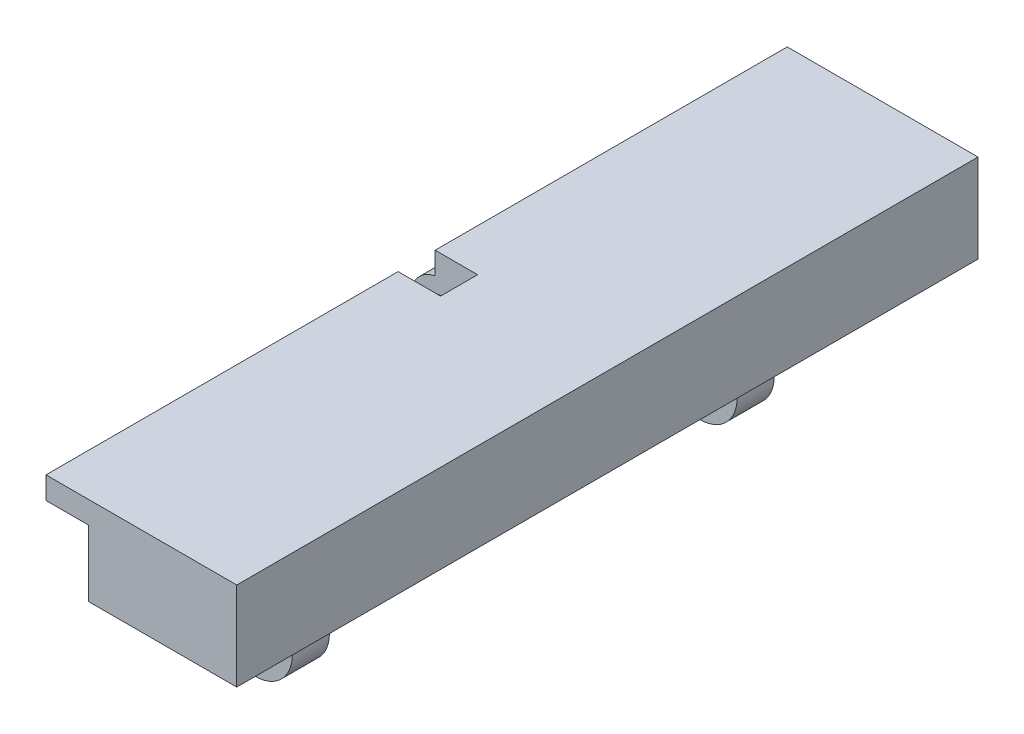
ISO-10303-21;
HEADER;
FILE_DESCRIPTION(('STEP AP214'),'2;1');
FILE_NAME('part.step','',(''),(''),'','','');
FILE_SCHEMA(('AUTOMOTIVE_DESIGN { 1 0 10303 214 1 1 1 1 }'));
ENDSEC;
DATA;
#1=APPLICATION_CONTEXT('core data for automotive mechanical design processes');
#2=APPLICATION_PROTOCOL_DEFINITION('international standard','automotive_design',2000,#1);
#3=PRODUCT_CONTEXT('',#1,'mechanical');
#4=PRODUCT('Part','Part','',(#3));
#5=PRODUCT_RELATED_PRODUCT_CATEGORY('part','',(#4));
#6=PRODUCT_DEFINITION_FORMATION('','',#4);
#7=PRODUCT_DEFINITION_CONTEXT('part definition',#1,'design');
#8=PRODUCT_DEFINITION('design','',#6,#7);
#9=PRODUCT_DEFINITION_SHAPE('','',#8);
#10=(LENGTH_UNIT() NAMED_UNIT(*) SI_UNIT(.MILLI.,.METRE.));
#11=(NAMED_UNIT(*) PLANE_ANGLE_UNIT() SI_UNIT($,.RADIAN.));
#12=(NAMED_UNIT(*) SI_UNIT($,.STERADIAN.) SOLID_ANGLE_UNIT());
#13=UNCERTAINTY_MEASURE_WITH_UNIT(LENGTH_MEASURE(1.E-05),#10,'distance_accuracy_value','');
#14=(GEOMETRIC_REPRESENTATION_CONTEXT(3) GLOBAL_UNCERTAINTY_ASSIGNED_CONTEXT((#13)) GLOBAL_UNIT_ASSIGNED_CONTEXT((#10,
#11,#12)) REPRESENTATION_CONTEXT('',''));
#15=CARTESIAN_POINT('',(0.,0.,0.));
#16=DIRECTION('',(0.,0.,1.));
#17=DIRECTION('',(1.,0.,0.));
#18=AXIS2_PLACEMENT_3D('',#15,#16,#17);
#19=CARTESIAN_POINT('',(-157.323807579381,100.,-500.));
#20=DIRECTION('',(-1.,0.,0.));
#21=DIRECTION('',(0.,0.,1.));
#22=AXIS2_PLACEMENT_3D('',#19,#20,#21);
#23=PLANE('',#22);
#24=DIRECTION('',(0.,1.,0.));
#25=VECTOR('',#24,1.);
#26=CARTESIAN_POINT('',(-157.323807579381,100.,25.));
#27=LINE('',#26,#25);
#28=CARTESIAN_POINT('',(-157.323807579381,89.3238075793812,25.));
#29=VERTEX_POINT('',#28);
#30=CARTESIAN_POINT('',(-157.323807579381,119.323807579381,25.));
#31=VERTEX_POINT('',#30);
#32=EDGE_CURVE('E217',#29,#31,#27,.T.);
#33=ORIENTED_EDGE('',*,*,#32,.F.);
#34=DIRECTION('',(0.,0.,-1.));
#35=VECTOR('',#34,1.);
#36=CARTESIAN_POINT('',(-157.323807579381,89.3238075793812,75.));
#37=LINE('',#36,#35);
#38=CARTESIAN_POINT('',(-157.323807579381,89.3238075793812,75.));
#39=VERTEX_POINT('',#38);
#40=EDGE_CURVE('E310',#39,#29,#37,.T.);
#41=ORIENTED_EDGE('',*,*,#40,.F.);
#42=DIRECTION('',(0.,0.,1.));
#43=VECTOR('',#42,1.);
#44=CARTESIAN_POINT('',(-157.323807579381,89.3238075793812,-500.));
#45=LINE('',#44,#43);
#46=CARTESIAN_POINT('',(-157.323807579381,89.3238075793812,500.));
#47=VERTEX_POINT('',#46);
#48=EDGE_CURVE('E247',#39,#47,#45,.T.);
#49=ORIENTED_EDGE('',*,*,#48,.T.);
#50=DIRECTION('',(0.,-1.,0.));
#51=VECTOR('',#50,1.);
#52=CARTESIAN_POINT('',(-157.323807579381,100.,500.));
#53=LINE('',#52,#51);
#54=CARTESIAN_POINT('',(-157.323807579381,119.323807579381,500.));
#55=VERTEX_POINT('',#54);
#56=EDGE_CURVE('E237',#55,#47,#53,.T.);
#57=ORIENTED_EDGE('',*,*,#56,.F.);
#58=DIRECTION('',(0.,0.,1.));
#59=VECTOR('',#58,1.);
#60=CARTESIAN_POINT('',(-157.323807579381,119.323807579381,-500.));
#61=LINE('',#60,#59);
#62=EDGE_CURVE('E238',#31,#55,#61,.T.);
#63=ORIENTED_EDGE('',*,*,#62,.F.);
#64=EDGE_LOOP('',(#33,#41,#49,#57,#63));
#65=FACE_BOUND('',#64,.T.);
#66=ADVANCED_FACE('F33',(#65),#23,.T.);
#67=CARTESIAN_POINT('',(-100.,0.,500.));
#68=DIRECTION('',(1.,0.,0.));
#69=DIRECTION('',(0.,0.,-1.));
#70=AXIS2_PLACEMENT_3D('',#67,#68,#69);
#71=PLANE('',#70);
#72=DIRECTION('',(0.,1.,0.));
#73=VECTOR('',#72,1.);
#74=CARTESIAN_POINT('',(-100.,100.,25.));
#75=LINE('',#74,#73);
#76=CARTESIAN_POINT('',(-100.,0.,25.));
#77=VERTEX_POINT('',#76);
#78=CARTESIAN_POINT('',(-100.,119.323807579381,25.));
#79=VERTEX_POINT('',#78);
#80=EDGE_CURVE('E199',#77,#79,#75,.T.);
#81=ORIENTED_EDGE('',*,*,#80,.T.);
#82=DIRECTION('',(0.,0.,1.));
#83=VECTOR('',#82,1.);
#84=CARTESIAN_POINT('',(-100.,119.323807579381,25.));
#85=LINE('',#84,#83);
#86=CARTESIAN_POINT('',(-100.,119.323807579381,-25.));
#87=VERTEX_POINT('',#86);
#88=EDGE_CURVE('E203',#87,#79,#85,.T.);
#89=ORIENTED_EDGE('',*,*,#88,.F.);
#90=DIRECTION('',(0.,1.,0.));
#91=VECTOR('',#90,1.);
#92=CARTESIAN_POINT('',(-100.,100.,-25.));
#93=LINE('',#92,#91);
#94=CARTESIAN_POINT('',(-100.,0.,-25.));
#95=VERTEX_POINT('',#94);
#96=EDGE_CURVE('E47',#95,#87,#93,.T.);
#97=ORIENTED_EDGE('',*,*,#96,.F.);
#98=DIRECTION('',(0.,0.,-1.));
#99=VECTOR('',#98,1.);
#100=CARTESIAN_POINT('',(-100.,0.,500.));
#101=LINE('',#100,#99);
#102=EDGE_CURVE('E206',#77,#95,#101,.T.);
#103=ORIENTED_EDGE('',*,*,#102,.F.);
#104=EDGE_LOOP('',(#81,#89,#97,#103));
#105=FACE_BOUND('',#104,.T.);
#106=ADVANCED_FACE('F201',(#105),#71,.F.);
#107=DIRECTION('',(0.,1.,0.));
#108=VECTOR('',#107,1.);
#109=CARTESIAN_POINT('',(-100.,100.,-75.));
#110=LINE('',#109,#108);
#111=CARTESIAN_POINT('',(-100.,0.,-75.));
#112=VERTEX_POINT('',#111);
#113=CARTESIAN_POINT('',(-100.,89.3238075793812,-75.));
#114=VERTEX_POINT('',#113);
#115=EDGE_CURVE('E272',#112,#114,#110,.T.);
#116=ORIENTED_EDGE('',*,*,#115,.T.);
#117=DIRECTION('',(0.,0.,1.));
#118=VECTOR('',#117,1.);
#119=CARTESIAN_POINT('',(-100.,89.3238075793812,-500.));
#120=LINE('',#119,#118);
#121=CARTESIAN_POINT('',(-100.,89.3238075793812,-500.));
#122=VERTEX_POINT('',#121);
#123=EDGE_CURVE('E252',#122,#114,#120,.T.);
#124=ORIENTED_EDGE('',*,*,#123,.F.);
#125=DIRECTION('',(0.,-1.,0.));
#126=VECTOR('',#125,1.);
#127=CARTESIAN_POINT('',(-100.,0.,-500.));
#128=LINE('',#127,#126);
#129=CARTESIAN_POINT('',(-100.,0.,-500.));
#130=VERTEX_POINT('',#129);
#131=EDGE_CURVE('E503',#122,#130,#128,.T.);
#132=ORIENTED_EDGE('',*,*,#131,.T.);
#133=CARTESIAN_POINT('',(-100.,0.,-325.));
#134=VERTEX_POINT('',#133);
#135=EDGE_CURVE('E378',#134,#130,#101,.T.);
#136=ORIENTED_EDGE('',*,*,#135,.F.);
#137=DIRECTION('',(0.,-1.,0.));
#138=VECTOR('',#137,1.);
#139=CARTESIAN_POINT('',(-100.,0.,-325.));
#140=LINE('',#139,#138);
#141=CARTESIAN_POINT('',(-100.,-100.,-325.));
#142=VERTEX_POINT('',#141);
#143=EDGE_CURVE('E327',#134,#142,#140,.T.);
#144=ORIENTED_EDGE('',*,*,#143,.T.);
#145=DIRECTION('',(0.,0.,1.));
#146=VECTOR('',#145,1.);
#147=CARTESIAN_POINT('',(-100.,-100.,-325.));
#148=LINE('',#147,#146);
#149=CARTESIAN_POINT('',(-100.,-100.,-275.));
#150=VERTEX_POINT('',#149);
#151=EDGE_CURVE('E348',#142,#150,#148,.T.);
#152=ORIENTED_EDGE('',*,*,#151,.T.);
#153=DIRECTION('',(0.,-1.,0.));
#154=VECTOR('',#153,1.);
#155=CARTESIAN_POINT('',(-100.,0.,-275.));
#156=LINE('',#155,#154);
#157=CARTESIAN_POINT('',(-100.,0.,-275.));
#158=VERTEX_POINT('',#157);
#159=EDGE_CURVE('E339',#158,#150,#156,.T.);
#160=ORIENTED_EDGE('',*,*,#159,.F.);
#161=EDGE_CURVE('E55',#112,#158,#101,.T.);
#162=ORIENTED_EDGE('',*,*,#161,.F.);
#163=EDGE_LOOP('',(#116,#124,#132,#136,#144,#152,#160,#162));
#164=FACE_BOUND('',#163,.T.);
#165=ADVANCED_FACE('F428',(#164),#71,.F.);
#166=DIRECTION('',(0.,-1.,0.));
#167=VECTOR('',#166,1.);
#168=CARTESIAN_POINT('',(-100.,0.,500.));
#169=LINE('',#168,#167);
#170=CARTESIAN_POINT('',(-100.,89.3238075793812,500.));
#171=VERTEX_POINT('',#170);
#172=CARTESIAN_POINT('',(-100.,0.,500.));
#173=VERTEX_POINT('',#172);
#174=EDGE_CURVE('E490',#171,#173,#169,.T.);
#175=ORIENTED_EDGE('',*,*,#174,.F.);
#176=CARTESIAN_POINT('',(-100.,89.3238075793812,75.));
#177=VERTEX_POINT('',#176);
#178=EDGE_CURVE('E255',#177,#171,#120,.T.);
#179=ORIENTED_EDGE('',*,*,#178,.F.);
#180=DIRECTION('',(0.,1.,0.));
#181=VECTOR('',#180,1.);
#182=CARTESIAN_POINT('',(-100.,100.,75.));
#183=LINE('',#182,#181);
#184=CARTESIAN_POINT('',(-100.,0.,75.));
#185=VERTEX_POINT('',#184);
#186=EDGE_CURVE('E293',#185,#177,#183,.T.);
#187=ORIENTED_EDGE('',*,*,#186,.F.);
#188=CARTESIAN_POINT('',(-100.,0.,275.));
#189=VERTEX_POINT('',#188);
#190=EDGE_CURVE('E392',#189,#185,#101,.T.);
#191=ORIENTED_EDGE('',*,*,#190,.F.);
#192=DIRECTION('',(0.,-1.,0.));
#193=VECTOR('',#192,1.);
#194=CARTESIAN_POINT('',(-100.,0.,275.));
#195=LINE('',#194,#193);
#196=CARTESIAN_POINT('',(-100.,-100.,275.));
#197=VERTEX_POINT('',#196);
#198=EDGE_CURVE('E355',#189,#197,#195,.T.);
#199=ORIENTED_EDGE('',*,*,#198,.T.);
#200=DIRECTION('',(0.,0.,-1.));
#201=VECTOR('',#200,1.);
#202=CARTESIAN_POINT('',(-100.,-100.,325.));
#203=LINE('',#202,#201);
#204=CARTESIAN_POINT('',(-100.,-100.,325.));
#205=VERTEX_POINT('',#204);
#206=EDGE_CURVE('E367',#205,#197,#203,.T.);
#207=ORIENTED_EDGE('',*,*,#206,.F.);
#208=DIRECTION('',(0.,-1.,0.));
#209=VECTOR('',#208,1.);
#210=CARTESIAN_POINT('',(-100.,0.,325.));
#211=LINE('',#210,#209);
#212=CARTESIAN_POINT('',(-100.,0.,325.));
#213=VERTEX_POINT('',#212);
#214=EDGE_CURVE('E864',#213,#205,#211,.T.);
#215=ORIENTED_EDGE('',*,*,#214,.F.);
#216=EDGE_CURVE('E388',#173,#213,#101,.T.);
#217=ORIENTED_EDGE('',*,*,#216,.F.);
#218=EDGE_LOOP('',(#175,#179,#187,#191,#199,#207,#215,#217));
#219=FACE_BOUND('',#218,.T.);
#220=ADVANCED_FACE('F430',(#219),#71,.F.);
#221=CARTESIAN_POINT('',(-100.,0.,500.));
#222=DIRECTION('',(0.,1.,0.));
#223=DIRECTION('',(0.,0.,1.));
#224=AXIS2_PLACEMENT_3D('',#221,#222,#223);
#225=PLANE('',#224);
#226=DIRECTION('',(0.,0.,-1.));
#227=VECTOR('',#226,1.);
#228=CARTESIAN_POINT('',(50.,0.,275.));
#229=LINE('',#228,#227);
#230=CARTESIAN_POINT('',(50.,0.,325.));
#231=VERTEX_POINT('',#230);
#232=CARTESIAN_POINT('',(50.,0.,275.));
#233=VERTEX_POINT('',#232);
#234=EDGE_CURVE('E515',#231,#233,#229,.T.);
#235=ORIENTED_EDGE('',*,*,#234,.T.);
#236=DIRECTION('',(-1.,0.,0.));
#237=VECTOR('',#236,1.);
#238=CARTESIAN_POINT('',(-100.,0.,275.));
#239=LINE('',#238,#237);
#240=EDGE_CURVE('E364',#233,#189,#239,.T.);
#241=ORIENTED_EDGE('',*,*,#240,.T.);
#242=ORIENTED_EDGE('',*,*,#190,.T.);
#243=DIRECTION('',(0.,0.,-1.));
#244=VECTOR('',#243,1.);
#245=CARTESIAN_POINT('',(-100.,0.,75.));
#246=LINE('',#245,#244);
#247=EDGE_CURVE('E301',#185,#77,#246,.T.);
#248=ORIENTED_EDGE('',*,*,#247,.T.);
#249=ORIENTED_EDGE('',*,*,#102,.T.);
#250=DIRECTION('',(0.,0.,1.));
#251=VECTOR('',#250,1.);
#252=CARTESIAN_POINT('',(-100.,0.,-75.));
#253=LINE('',#252,#251);
#254=EDGE_CURVE('E211',#112,#95,#253,.T.);
#255=ORIENTED_EDGE('',*,*,#254,.F.);
#256=ORIENTED_EDGE('',*,*,#161,.T.);
#257=DIRECTION('',(-1.,0.,0.));
#258=VECTOR('',#257,1.);
#259=CARTESIAN_POINT('',(-100.,0.,-275.));
#260=LINE('',#259,#258);
#261=CARTESIAN_POINT('',(50.,0.,-275.));
#262=VERTEX_POINT('',#261);
#263=EDGE_CURVE('E342',#262,#158,#260,.T.);
#264=ORIENTED_EDGE('',*,*,#263,.F.);
#265=DIRECTION('',(0.,0.,1.));
#266=VECTOR('',#265,1.);
#267=CARTESIAN_POINT('',(50.,0.,500.));
#268=LINE('',#267,#266);
#269=CARTESIAN_POINT('',(50.,0.,-325.));
#270=VERTEX_POINT('',#269);
#271=EDGE_CURVE('E513',#262,#270,#268,.F.);
#272=ORIENTED_EDGE('',*,*,#271,.T.);
#273=DIRECTION('',(-1.,0.,0.));
#274=VECTOR('',#273,1.);
#275=CARTESIAN_POINT('',(-100.,0.,-325.));
#276=LINE('',#275,#274);
#277=EDGE_CURVE('E331',#270,#134,#276,.T.);
#278=ORIENTED_EDGE('',*,*,#277,.T.);
#279=ORIENTED_EDGE('',*,*,#135,.T.);
#280=DIRECTION('',(1.,0.,0.));
#281=VECTOR('',#280,1.);
#282=CARTESIAN_POINT('',(-100.,0.,-500.));
#283=LINE('',#282,#281);
#284=CARTESIAN_POINT('',(100.,0.,-500.));
#285=VERTEX_POINT('',#284);
#286=EDGE_CURVE('E499',#130,#285,#283,.T.);
#287=ORIENTED_EDGE('',*,*,#286,.T.);
#288=DIRECTION('',(0.,0.,-1.));
#289=VECTOR('',#288,1.);
#290=CARTESIAN_POINT('',(100.,0.,500.));
#291=LINE('',#290,#289);
#292=CARTESIAN_POINT('',(100.,0.,500.));
#293=VERTEX_POINT('',#292);
#294=EDGE_CURVE('E382',#293,#285,#291,.T.);
#295=ORIENTED_EDGE('',*,*,#294,.F.);
#296=DIRECTION('',(1.,0.,0.));
#297=VECTOR('',#296,1.);
#298=CARTESIAN_POINT('',(-100.,0.,500.));
#299=LINE('',#298,#297);
#300=EDGE_CURVE('E495',#173,#293,#299,.T.);
#301=ORIENTED_EDGE('',*,*,#300,.F.);
#302=ORIENTED_EDGE('',*,*,#216,.T.);
#303=DIRECTION('',(-1.,0.,0.));
#304=VECTOR('',#303,1.);
#305=CARTESIAN_POINT('',(-100.,0.,325.));
#306=LINE('',#305,#304);
#307=EDGE_CURVE('E358',#231,#213,#306,.T.);
#308=ORIENTED_EDGE('',*,*,#307,.F.);
#309=EDGE_LOOP('',(#235,#241,#242,#248,#249,#255,#256,#264,#272,#278,#279,#287,#295,#301,#302,#308));
#310=FACE_BOUND('',#309,.T.);
#311=ADVANCED_FACE('F467',(#310),#225,.F.);
#312=CARTESIAN_POINT('',(100.,0.,500.));
#313=DIRECTION('',(-1.,0.,0.));
#314=DIRECTION('',(0.,0.,1.));
#315=AXIS2_PLACEMENT_3D('',#312,#313,#314);
#316=PLANE('',#315);
#317=DIRECTION('',(0.,1.,0.));
#318=VECTOR('',#317,1.);
#319=CARTESIAN_POINT('',(100.,0.,-500.));
#320=LINE('',#319,#318);
#321=CARTESIAN_POINT('',(100.,119.323807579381,-500.));
#322=VERTEX_POINT('',#321);
#323=EDGE_CURVE('E452',#285,#322,#320,.T.);
#324=ORIENTED_EDGE('',*,*,#323,.T.);
#325=DIRECTION('',(0.,0.,1.));
#326=VECTOR('',#325,1.);
#327=CARTESIAN_POINT('',(100.,119.323807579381,-500.));
#328=LINE('',#327,#326);
#329=CARTESIAN_POINT('',(100.,119.323807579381,500.));
#330=VERTEX_POINT('',#329);
#331=EDGE_CURVE('E232',#322,#330,#328,.T.);
#332=ORIENTED_EDGE('',*,*,#331,.T.);
#333=DIRECTION('',(0.,1.,0.));
#334=VECTOR('',#333,1.);
#335=CARTESIAN_POINT('',(100.,0.,500.));
#336=LINE('',#335,#334);
#337=EDGE_CURVE('E497',#293,#330,#336,.T.);
#338=ORIENTED_EDGE('',*,*,#337,.F.);
#339=ORIENTED_EDGE('',*,*,#294,.T.);
#340=EDGE_LOOP('',(#324,#332,#338,#339));
#341=FACE_BOUND('',#340,.T.);
#342=ADVANCED_FACE('F510',(#341),#316,.F.);
#343=CARTESIAN_POINT('',(-100.,100.,500.));
#344=DIRECTION('',(0.,0.,-1.));
#345=DIRECTION('',(-1.,0.,0.));
#346=AXIS2_PLACEMENT_3D('',#343,#344,#345);
#347=PLANE('',#346);
#348=ORIENTED_EDGE('',*,*,#337,.T.);
#349=DIRECTION('',(-1.,0.,0.));
#350=VECTOR('',#349,1.);
#351=CARTESIAN_POINT('',(-157.323807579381,119.323807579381,500.));
#352=LINE('',#351,#350);
#353=EDGE_CURVE('E228',#330,#55,#352,.T.);
#354=ORIENTED_EDGE('',*,*,#353,.T.);
#355=ORIENTED_EDGE('',*,*,#56,.T.);
#356=DIRECTION('',(1.,0.,0.));
#357=VECTOR('',#356,1.);
#358=CARTESIAN_POINT('',(-100.,89.3238075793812,500.));
#359=LINE('',#358,#357);
#360=EDGE_CURVE('E245',#47,#171,#359,.T.);
#361=ORIENTED_EDGE('',*,*,#360,.T.);
#362=ORIENTED_EDGE('',*,*,#174,.T.);
#363=ORIENTED_EDGE('',*,*,#300,.T.);
#364=EDGE_LOOP('',(#348,#354,#355,#361,#362,#363));
#365=FACE_BOUND('',#364,.T.);
#366=ADVANCED_FACE('F511',(#365),#347,.F.);
#367=CARTESIAN_POINT('',(-100.,100.,-500.));
#368=DIRECTION('',(0.,0.,-1.));
#369=DIRECTION('',(-1.,0.,0.));
#370=AXIS2_PLACEMENT_3D('',#367,#368,#369);
#371=PLANE('',#370);
#372=ORIENTED_EDGE('',*,*,#131,.F.);
#373=DIRECTION('',(1.,0.,0.));
#374=VECTOR('',#373,1.);
#375=CARTESIAN_POINT('',(-100.,89.3238075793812,-500.));
#376=LINE('',#375,#374);
#377=CARTESIAN_POINT('',(-157.323807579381,89.3238075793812,-500.));
#378=VERTEX_POINT('',#377);
#379=EDGE_CURVE('E244',#378,#122,#376,.T.);
#380=ORIENTED_EDGE('',*,*,#379,.F.);
#381=DIRECTION('',(0.,-1.,0.));
#382=VECTOR('',#381,1.);
#383=CARTESIAN_POINT('',(-157.323807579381,100.,-500.));
#384=LINE('',#383,#382);
#385=CARTESIAN_POINT('',(-157.323807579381,119.323807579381,-500.));
#386=VERTEX_POINT('',#385);
#387=EDGE_CURVE('E241',#386,#378,#384,.T.);
#388=ORIENTED_EDGE('',*,*,#387,.F.);
#389=DIRECTION('',(-1.,0.,0.));
#390=VECTOR('',#389,1.);
#391=CARTESIAN_POINT('',(-157.323807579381,119.323807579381,-500.));
#392=LINE('',#391,#390);
#393=EDGE_CURVE('E229',#322,#386,#392,.T.);
#394=ORIENTED_EDGE('',*,*,#393,.F.);
#395=ORIENTED_EDGE('',*,*,#323,.F.);
#396=ORIENTED_EDGE('',*,*,#286,.F.);
#397=EDGE_LOOP('',(#372,#380,#388,#394,#395,#396));
#398=FACE_BOUND('',#397,.T.);
#399=ADVANCED_FACE('F450',(#398),#371,.T.);
#400=CARTESIAN_POINT('',(-50.,-100.,325.));
#401=DIRECTION('',(0.,0.,-1.));
#402=DIRECTION('',(-1.,0.,0.));
#403=AXIS2_PLACEMENT_3D('',#400,#401,#402);
#404=CYLINDRICAL_SURFACE('',#403,50.);
#405=CARTESIAN_POINT('',(-50.,-100.,275.));
#406=DIRECTION('',(0.,0.,1.));
#407=DIRECTION('',(1.,0.,0.));
#408=AXIS2_PLACEMENT_3D('',#405,#406,#407);
#409=CIRCLE('',#408,50.);
#410=CARTESIAN_POINT('',(0.,-100.,275.));
#411=VERTEX_POINT('',#410);
#412=EDGE_CURVE('E350',#197,#411,#409,.T.);
#413=ORIENTED_EDGE('',*,*,#412,.T.);
#414=DIRECTION('',(0.,0.,-1.));
#415=VECTOR('',#414,1.);
#416=CARTESIAN_POINT('',(0.,-100.,325.));
#417=LINE('',#416,#415);
#418=CARTESIAN_POINT('',(0.,-100.,325.));
#419=VERTEX_POINT('',#418);
#420=EDGE_CURVE('E500',#419,#411,#417,.T.);
#421=ORIENTED_EDGE('',*,*,#420,.F.);
#422=CARTESIAN_POINT('',(-50.,-100.,325.));
#423=DIRECTION('',(0.,0.,1.));
#424=DIRECTION('',(1.,0.,0.));
#425=AXIS2_PLACEMENT_3D('',#422,#423,#424);
#426=CIRCLE('',#425,50.);
#427=EDGE_CURVE('E351',#205,#419,#426,.T.);
#428=ORIENTED_EDGE('',*,*,#427,.F.);
#429=ORIENTED_EDGE('',*,*,#206,.T.);
#430=EDGE_LOOP('',(#413,#421,#428,#429));
#431=FACE_BOUND('',#430,.T.);
#432=ADVANCED_FACE('F566',(#431),#404,.T.);
#433=CARTESIAN_POINT('',(0.,0.,325.));
#434=DIRECTION('',(-1.,0.,0.));
#435=DIRECTION('',(0.,0.,1.));
#436=AXIS2_PLACEMENT_3D('',#433,#434,#435);
#437=PLANE('',#436);
#438=DIRECTION('',(0.,1.,0.));
#439=VECTOR('',#438,1.);
#440=CARTESIAN_POINT('',(0.,0.,275.));
#441=LINE('',#440,#439);
#442=CARTESIAN_POINT('',(0.,-50.,275.));
#443=VERTEX_POINT('',#442);
#444=EDGE_CURVE('E361',#411,#443,#441,.T.);
#445=ORIENTED_EDGE('',*,*,#444,.T.);
#446=DIRECTION('',(0.,0.,-1.));
#447=VECTOR('',#446,1.);
#448=CARTESIAN_POINT('',(0.,-50.,325.));
#449=LINE('',#448,#447);
#450=CARTESIAN_POINT('',(0.,-50.,325.));
#451=VERTEX_POINT('',#450);
#452=EDGE_CURVE('E518',#443,#451,#449,.F.);
#453=ORIENTED_EDGE('',*,*,#452,.T.);
#454=DIRECTION('',(0.,1.,0.));
#455=VECTOR('',#454,1.);
#456=CARTESIAN_POINT('',(0.,0.,325.));
#457=LINE('',#456,#455);
#458=EDGE_CURVE('E354',#419,#451,#457,.T.);
#459=ORIENTED_EDGE('',*,*,#458,.F.);
#460=ORIENTED_EDGE('',*,*,#420,.T.);
#461=EDGE_LOOP('',(#445,#453,#459,#460));
#462=FACE_BOUND('',#461,.T.);
#463=ADVANCED_FACE('F571',(#462),#437,.F.);
#464=CARTESIAN_POINT('',(-50.,-100.,325.));
#465=DIRECTION('',(0.,0.,1.));
#466=DIRECTION('',(1.,0.,0.));
#467=AXIS2_PLACEMENT_3D('',#464,#465,#466);
#468=PLANE('',#467);
#469=CARTESIAN_POINT('',(-50.,-100.,325.));
#470=DIRECTION('',(0.,0.,1.));
#471=DIRECTION('',(1.,0.,0.));
#472=AXIS2_PLACEMENT_3D('',#469,#470,#471);
#473=CIRCLE('',#472,30.);
#474=CARTESIAN_POINT('',(-20.,-100.,325.));
#475=VERTEX_POINT('',#474);
#476=EDGE_CURVE('E320',#475,#475,#473,.T.);
#477=ORIENTED_EDGE('',*,*,#476,.F.);
#478=EDGE_LOOP('',(#477));
#479=FACE_BOUND('',#478,.T.);
#480=ORIENTED_EDGE('',*,*,#427,.T.);
#481=ORIENTED_EDGE('',*,*,#458,.T.);
#482=CARTESIAN_POINT('',(50.,-50.,325.));
#483=DIRECTION('',(0.,0.,1.));
#484=DIRECTION('',(1.,0.,0.));
#485=AXIS2_PLACEMENT_3D('',#482,#483,#484);
#486=CIRCLE('',#485,50.);
#487=EDGE_CURVE('E527',#451,#231,#486,.F.);
#488=ORIENTED_EDGE('',*,*,#487,.T.);
#489=ORIENTED_EDGE('',*,*,#307,.T.);
#490=ORIENTED_EDGE('',*,*,#214,.T.);
#491=EDGE_LOOP('',(#480,#481,#488,#489,#490));
#492=FACE_BOUND('',#491,.T.);
#493=ADVANCED_FACE('F575',(#479,#492),#468,.T.);
#494=CARTESIAN_POINT('',(-50.,-100.,275.));
#495=DIRECTION('',(0.,0.,1.));
#496=DIRECTION('',(1.,0.,0.));
#497=AXIS2_PLACEMENT_3D('',#494,#495,#496);
#498=PLANE('',#497);
#499=CARTESIAN_POINT('',(-50.,-100.,275.));
#500=DIRECTION('',(0.,0.,1.));
#501=DIRECTION('',(1.,0.,0.));
#502=AXIS2_PLACEMENT_3D('',#499,#500,#501);
#503=CIRCLE('',#502,30.);
#504=CARTESIAN_POINT('',(-20.,-100.,275.));
#505=VERTEX_POINT('',#504);
#506=EDGE_CURVE('E317',#505,#505,#503,.T.);
#507=ORIENTED_EDGE('',*,*,#506,.T.);
#508=EDGE_LOOP('',(#507));
#509=FACE_BOUND('',#508,.T.);
#510=ORIENTED_EDGE('',*,*,#412,.F.);
#511=ORIENTED_EDGE('',*,*,#198,.F.);
#512=ORIENTED_EDGE('',*,*,#240,.F.);
#513=CARTESIAN_POINT('',(50.,-50.,275.));
#514=DIRECTION('',(0.,0.,1.));
#515=DIRECTION('',(1.,0.,0.));
#516=AXIS2_PLACEMENT_3D('',#513,#514,#515);
#517=CIRCLE('',#516,50.);
#518=EDGE_CURVE('E525',#233,#443,#517,.T.);
#519=ORIENTED_EDGE('',*,*,#518,.T.);
#520=ORIENTED_EDGE('',*,*,#444,.F.);
#521=EDGE_LOOP('',(#510,#511,#512,#519,#520));
#522=FACE_BOUND('',#521,.T.);
#523=ADVANCED_FACE('F577',(#509,#522),#498,.F.);
#524=CARTESIAN_POINT('',(-50.,-100.,-325.));
#525=DIRECTION('',(0.,0.,1.));
#526=DIRECTION('',(1.,0.,0.));
#527=AXIS2_PLACEMENT_3D('',#524,#525,#526);
#528=CYLINDRICAL_SURFACE('',#527,50.);
#529=CARTESIAN_POINT('',(-50.,-100.,-275.));
#530=DIRECTION('',(0.,0.,1.));
#531=DIRECTION('',(1.,0.,0.));
#532=AXIS2_PLACEMENT_3D('',#529,#530,#531);
#533=CIRCLE('',#532,50.);
#534=CARTESIAN_POINT('',(0.,-100.,-275.));
#535=VERTEX_POINT('',#534);
#536=EDGE_CURVE('E323',#150,#535,#533,.T.);
#537=ORIENTED_EDGE('',*,*,#536,.F.);
#538=ORIENTED_EDGE('',*,*,#151,.F.);
#539=CARTESIAN_POINT('',(-50.,-100.,-325.));
#540=DIRECTION('',(0.,0.,1.));
#541=DIRECTION('',(1.,0.,0.));
#542=AXIS2_PLACEMENT_3D('',#539,#540,#541);
#543=CIRCLE('',#542,50.);
#544=CARTESIAN_POINT('',(0.,-100.,-325.));
#545=VERTEX_POINT('',#544);
#546=EDGE_CURVE('E324',#142,#545,#543,.T.);
#547=ORIENTED_EDGE('',*,*,#546,.T.);
#548=DIRECTION('',(0.,0.,1.));
#549=VECTOR('',#548,1.);
#550=CARTESIAN_POINT('',(0.,-100.,-325.));
#551=LINE('',#550,#549);
#552=EDGE_CURVE('E336',#545,#535,#551,.T.);
#553=ORIENTED_EDGE('',*,*,#552,.T.);
#554=EDGE_LOOP('',(#537,#538,#547,#553));
#555=FACE_BOUND('',#554,.T.);
#556=ADVANCED_FACE('F580',(#555),#528,.T.);
#557=CARTESIAN_POINT('',(0.,0.,-325.));
#558=DIRECTION('',(1.,0.,0.));
#559=DIRECTION('',(0.,0.,-1.));
#560=AXIS2_PLACEMENT_3D('',#557,#558,#559);
#561=PLANE('',#560);
#562=DIRECTION('',(0.,1.,0.));
#563=VECTOR('',#562,1.);
#564=CARTESIAN_POINT('',(0.,0.,-325.));
#565=LINE('',#564,#563);
#566=CARTESIAN_POINT('',(0.,-50.,-325.));
#567=VERTEX_POINT('',#566);
#568=EDGE_CURVE('E333',#545,#567,#565,.T.);
#569=ORIENTED_EDGE('',*,*,#568,.T.);
#570=DIRECTION('',(0.,0.,1.));
#571=VECTOR('',#570,1.);
#572=CARTESIAN_POINT('',(0.,-50.,-325.));
#573=LINE('',#572,#571);
#574=CARTESIAN_POINT('',(0.,-50.,-275.));
#575=VERTEX_POINT('',#574);
#576=EDGE_CURVE('E522',#567,#575,#573,.T.);
#577=ORIENTED_EDGE('',*,*,#576,.T.);
#578=DIRECTION('',(0.,1.,0.));
#579=VECTOR('',#578,1.);
#580=CARTESIAN_POINT('',(0.,0.,-275.));
#581=LINE('',#580,#579);
#582=EDGE_CURVE('E328',#535,#575,#581,.T.);
#583=ORIENTED_EDGE('',*,*,#582,.F.);
#584=ORIENTED_EDGE('',*,*,#552,.F.);
#585=EDGE_LOOP('',(#569,#577,#583,#584));
#586=FACE_BOUND('',#585,.T.);
#587=ADVANCED_FACE('F539',(#586),#561,.T.);
#588=CARTESIAN_POINT('',(-50.,-100.,-325.));
#589=DIRECTION('',(0.,0.,-1.));
#590=DIRECTION('',(1.,0.,0.));
#591=AXIS2_PLACEMENT_3D('',#588,#589,#590);
#592=PLANE('',#591);
#593=CARTESIAN_POINT('',(-50.,-100.,-325.));
#594=DIRECTION('',(0.,0.,-1.));
#595=DIRECTION('',(-1.,0.,0.));
#596=AXIS2_PLACEMENT_3D('',#593,#594,#595);
#597=CIRCLE('',#596,30.);
#598=CARTESIAN_POINT('',(-80.,-100.,-325.));
#599=VERTEX_POINT('',#598);
#600=EDGE_CURVE('E313',#599,#599,#597,.T.);
#601=ORIENTED_EDGE('',*,*,#600,.F.);
#602=EDGE_LOOP('',(#601));
#603=FACE_BOUND('',#602,.T.);
#604=ORIENTED_EDGE('',*,*,#546,.F.);
#605=ORIENTED_EDGE('',*,*,#143,.F.);
#606=ORIENTED_EDGE('',*,*,#277,.F.);
#607=CARTESIAN_POINT('',(50.,-50.,-325.));
#608=DIRECTION('',(0.,0.,-1.));
#609=DIRECTION('',(-1.,0.,0.));
#610=AXIS2_PLACEMENT_3D('',#607,#608,#609);
#611=CIRCLE('',#610,50.);
#612=EDGE_CURVE('E41',#270,#567,#611,.F.);
#613=ORIENTED_EDGE('',*,*,#612,.T.);
#614=ORIENTED_EDGE('',*,*,#568,.F.);
#615=EDGE_LOOP('',(#604,#605,#606,#613,#614));
#616=FACE_BOUND('',#615,.T.);
#617=ADVANCED_FACE('F534',(#603,#616),#592,.T.);
#618=CARTESIAN_POINT('',(-50.,-100.,-275.));
#619=DIRECTION('',(0.,0.,-1.));
#620=DIRECTION('',(1.,0.,0.));
#621=AXIS2_PLACEMENT_3D('',#618,#619,#620);
#622=PLANE('',#621);
#623=CARTESIAN_POINT('',(-50.,-100.,-275.));
#624=DIRECTION('',(0.,0.,-1.));
#625=DIRECTION('',(-1.,0.,0.));
#626=AXIS2_PLACEMENT_3D('',#623,#624,#625);
#627=CIRCLE('',#626,30.);
#628=CARTESIAN_POINT('',(-80.,-100.,-275.));
#629=VERTEX_POINT('',#628);
#630=EDGE_CURVE('E316',#629,#629,#627,.T.);
#631=ORIENTED_EDGE('',*,*,#630,.T.);
#632=EDGE_LOOP('',(#631));
#633=FACE_BOUND('',#632,.T.);
#634=ORIENTED_EDGE('',*,*,#536,.T.);
#635=ORIENTED_EDGE('',*,*,#582,.T.);
#636=CARTESIAN_POINT('',(50.,-50.,-275.));
#637=DIRECTION('',(0.,0.,-1.));
#638=DIRECTION('',(-1.,0.,0.));
#639=AXIS2_PLACEMENT_3D('',#636,#637,#638);
#640=CIRCLE('',#639,50.);
#641=EDGE_CURVE('E528',#575,#262,#640,.T.);
#642=ORIENTED_EDGE('',*,*,#641,.T.);
#643=ORIENTED_EDGE('',*,*,#263,.T.);
#644=ORIENTED_EDGE('',*,*,#159,.T.);
#645=EDGE_LOOP('',(#634,#635,#642,#643,#644));
#646=FACE_BOUND('',#645,.T.);
#647=ADVANCED_FACE('F590',(#633,#646),#622,.F.);
#648=CARTESIAN_POINT('',(-50.,-100.,500.000025));
#649=DIRECTION('',(0.,0.,-1.));
#650=DIRECTION('',(-1.,0.,0.));
#651=AXIS2_PLACEMENT_3D('',#648,#649,#650);
#652=CYLINDRICAL_SURFACE('',#651,30.);
#653=ORIENTED_EDGE('',*,*,#600,.T.);
#654=EDGE_LOOP('',(#653));
#655=FACE_BOUND('',#654,.T.);
#656=ORIENTED_EDGE('',*,*,#630,.F.);
#657=EDGE_LOOP('',(#656));
#658=FACE_BOUND('',#657,.T.);
#659=ADVANCED_FACE('F554',(#655,#658),#652,.F.);
#660=ORIENTED_EDGE('',*,*,#476,.T.);
#661=EDGE_LOOP('',(#660));
#662=FACE_BOUND('',#661,.T.);
#663=ORIENTED_EDGE('',*,*,#506,.F.);
#664=EDGE_LOOP('',(#663));
#665=FACE_BOUND('',#664,.T.);
#666=ADVANCED_FACE('F549',(#662,#665),#652,.F.);
#667=CARTESIAN_POINT('',(50.,-50.,500.));
#668=DIRECTION('',(0.,0.,1.));
#669=DIRECTION('',(1.,0.,0.));
#670=AXIS2_PLACEMENT_3D('',#667,#668,#669);
#671=CYLINDRICAL_SURFACE('',#670,50.);
#672=ORIENTED_EDGE('',*,*,#487,.F.);
#673=ORIENTED_EDGE('',*,*,#452,.F.);
#674=ORIENTED_EDGE('',*,*,#518,.F.);
#675=ORIENTED_EDGE('',*,*,#234,.F.);
#676=EDGE_LOOP('',(#672,#673,#674,#675));
#677=FACE_BOUND('',#676,.T.);
#678=ADVANCED_FACE('F542',(#677),#671,.F.);
#679=CARTESIAN_POINT('',(50.,-50.,-325.));
#680=DIRECTION('',(0.,0.,1.));
#681=DIRECTION('',(1.,0.,0.));
#682=AXIS2_PLACEMENT_3D('',#679,#680,#681);
#683=CYLINDRICAL_SURFACE('',#682,50.);
#684=ORIENTED_EDGE('',*,*,#612,.F.);
#685=ORIENTED_EDGE('',*,*,#271,.F.);
#686=ORIENTED_EDGE('',*,*,#641,.F.);
#687=ORIENTED_EDGE('',*,*,#576,.F.);
#688=EDGE_LOOP('',(#684,#685,#686,#687));
#689=FACE_BOUND('',#688,.T.);
#690=ADVANCED_FACE('F35',(#689),#683,.F.);
#691=CARTESIAN_POINT('',(-150.,50.,75.));
#692=DIRECTION('',(0.,0.,-1.));
#693=DIRECTION('',(-1.,0.,0.));
#694=AXIS2_PLACEMENT_3D('',#691,#692,#693);
#695=CYLINDRICAL_SURFACE('',#694,40.);
#696=CARTESIAN_POINT('',(-150.,50.,25.));
#697=DIRECTION('',(0.,0.,1.));
#698=DIRECTION('',(1.,0.,0.));
#699=AXIS2_PLACEMENT_3D('',#696,#697,#698);
#700=CIRCLE('',#699,40.);
#701=CARTESIAN_POINT('',(-157.323807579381,10.6761924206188,25.));
#702=VERTEX_POINT('',#701);
#703=EDGE_CURVE('E210',#29,#702,#700,.T.);
#704=ORIENTED_EDGE('',*,*,#703,.T.);
#705=DIRECTION('',(0.,0.,-1.));
#706=VECTOR('',#705,1.);
#707=CARTESIAN_POINT('',(-157.323807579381,10.6761924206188,75.));
#708=LINE('',#707,#706);
#709=CARTESIAN_POINT('',(-157.323807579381,10.6761924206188,75.));
#710=VERTEX_POINT('',#709);
#711=EDGE_CURVE('E307',#710,#702,#708,.T.);
#712=ORIENTED_EDGE('',*,*,#711,.F.);
#713=CARTESIAN_POINT('',(-150.,50.,75.));
#714=DIRECTION('',(0.,0.,1.));
#715=DIRECTION('',(1.,0.,0.));
#716=AXIS2_PLACEMENT_3D('',#713,#714,#715);
#717=CIRCLE('',#716,40.);
#718=EDGE_CURVE('E296',#39,#710,#717,.T.);
#719=ORIENTED_EDGE('',*,*,#718,.F.);
#720=ORIENTED_EDGE('',*,*,#40,.T.);
#721=EDGE_LOOP('',(#704,#712,#719,#720));
#722=FACE_BOUND('',#721,.T.);
#723=ADVANCED_FACE('F476',(#722),#695,.T.);
#724=CARTESIAN_POINT('',(-100.,0.,75.));
#725=DIRECTION('',(0.18309518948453,0.98309518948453,0.));
#726=DIRECTION('',(-0.98309518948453,0.18309518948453,0.));
#727=AXIS2_PLACEMENT_3D('',#724,#725,#726);
#728=PLANE('',#727);
#729=DIRECTION('',(0.98309518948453,-0.18309518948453,0.));
#730=VECTOR('',#729,1.);
#731=CARTESIAN_POINT('',(-100.,0.,25.));
#732=LINE('',#731,#730);
#733=EDGE_CURVE('E297',#702,#77,#732,.T.);
#734=ORIENTED_EDGE('',*,*,#733,.T.);
#735=ORIENTED_EDGE('',*,*,#247,.F.);
#736=DIRECTION('',(0.98309518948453,-0.18309518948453,0.));
#737=VECTOR('',#736,1.);
#738=CARTESIAN_POINT('',(-100.,0.,75.));
#739=LINE('',#738,#737);
#740=EDGE_CURVE('E299',#710,#185,#739,.T.);
#741=ORIENTED_EDGE('',*,*,#740,.F.);
#742=ORIENTED_EDGE('',*,*,#711,.T.);
#743=EDGE_LOOP('',(#734,#735,#741,#742));
#744=FACE_BOUND('',#743,.T.);
#745=ADVANCED_FACE('F473',(#744),#728,.F.);
#746=CARTESIAN_POINT('',(-150.,50.,75.));
#747=DIRECTION('',(0.,0.,1.));
#748=DIRECTION('',(1.,0.,0.));
#749=AXIS2_PLACEMENT_3D('',#746,#747,#748);
#750=PLANE('',#749);
#751=DIRECTION('',(1.,0.,0.));
#752=VECTOR('',#751,1.);
#753=CARTESIAN_POINT('',(-150.,89.3238075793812,75.));
#754=LINE('',#753,#752);
#755=EDGE_CURVE('E260',#39,#177,#754,.T.);
#756=ORIENTED_EDGE('',*,*,#755,.F.);
#757=ORIENTED_EDGE('',*,*,#718,.T.);
#758=ORIENTED_EDGE('',*,*,#740,.T.);
#759=ORIENTED_EDGE('',*,*,#186,.T.);
#760=EDGE_LOOP('',(#756,#757,#758,#759));
#761=FACE_BOUND('',#760,.T.);
#762=CARTESIAN_POINT('',(-150.,50.,75.));
#763=DIRECTION('',(0.,0.,1.));
#764=DIRECTION('',(1.,0.,0.));
#765=AXIS2_PLACEMENT_3D('',#762,#763,#764);
#766=CIRCLE('',#765,20.);
#767=CARTESIAN_POINT('',(-130.,50.,75.));
#768=VERTEX_POINT('',#767);
#769=EDGE_CURVE('E262',#768,#768,#766,.T.);
#770=ORIENTED_EDGE('',*,*,#769,.F.);
#771=EDGE_LOOP('',(#770));
#772=FACE_BOUND('',#771,.T.);
#773=ADVANCED_FACE('F482',(#761,#772),#750,.T.);
#774=CARTESIAN_POINT('',(-150.,50.,25.));
#775=DIRECTION('',(0.,0.,1.));
#776=DIRECTION('',(1.,0.,0.));
#777=AXIS2_PLACEMENT_3D('',#774,#775,#776);
#778=PLANE('',#777);
#779=CARTESIAN_POINT('',(-150.,50.,25.));
#780=DIRECTION('',(0.,0.,1.));
#781=DIRECTION('',(1.,0.,0.));
#782=AXIS2_PLACEMENT_3D('',#779,#780,#781);
#783=CIRCLE('',#782,20.);
#784=CARTESIAN_POINT('',(-130.,50.,25.));
#785=VERTEX_POINT('',#784);
#786=EDGE_CURVE('E269',#785,#785,#783,.T.);
#787=ORIENTED_EDGE('',*,*,#786,.T.);
#788=EDGE_LOOP('',(#787));
#789=FACE_BOUND('',#788,.T.);
#790=ORIENTED_EDGE('',*,*,#703,.F.);
#791=ORIENTED_EDGE('',*,*,#32,.T.);
#792=DIRECTION('',(-1.,0.,0.));
#793=VECTOR('',#792,1.);
#794=CARTESIAN_POINT('',(-258.091177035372,119.323807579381,25.));
#795=LINE('',#794,#793);
#796=EDGE_CURVE('E214',#79,#31,#795,.T.);
#797=ORIENTED_EDGE('',*,*,#796,.F.);
#798=ORIENTED_EDGE('',*,*,#80,.F.);
#799=ORIENTED_EDGE('',*,*,#733,.F.);
#800=EDGE_LOOP('',(#790,#791,#797,#798,#799));
#801=FACE_BOUND('',#800,.T.);
#802=ADVANCED_FACE('F216',(#789,#801),#778,.F.);
#803=CARTESIAN_POINT('',(-100.,0.,-75.));
#804=DIRECTION('',(-0.18309518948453,-0.98309518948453,0.));
#805=DIRECTION('',(0.98309518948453,-0.18309518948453,0.));
#806=AXIS2_PLACEMENT_3D('',#803,#804,#805);
#807=PLANE('',#806);
#808=DIRECTION('',(0.98309518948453,-0.18309518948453,0.));
#809=VECTOR('',#808,1.);
#810=CARTESIAN_POINT('',(-100.,0.,-25.));
#811=LINE('',#810,#809);
#812=CARTESIAN_POINT('',(-157.323807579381,10.6761924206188,-25.));
#813=VERTEX_POINT('',#812);
#814=EDGE_CURVE('E283',#813,#95,#811,.T.);
#815=ORIENTED_EDGE('',*,*,#814,.F.);
#816=DIRECTION('',(0.,0.,1.));
#817=VECTOR('',#816,1.);
#818=CARTESIAN_POINT('',(-157.323807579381,10.6761924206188,-75.));
#819=LINE('',#818,#817);
#820=CARTESIAN_POINT('',(-157.323807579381,10.6761924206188,-75.));
#821=VERTEX_POINT('',#820);
#822=EDGE_CURVE('E289',#821,#813,#819,.T.);
#823=ORIENTED_EDGE('',*,*,#822,.F.);
#824=DIRECTION('',(0.98309518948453,-0.18309518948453,0.));
#825=VECTOR('',#824,1.);
#826=CARTESIAN_POINT('',(-100.,0.,-75.));
#827=LINE('',#826,#825);
#828=EDGE_CURVE('E274',#821,#112,#827,.T.);
#829=ORIENTED_EDGE('',*,*,#828,.T.);
#830=ORIENTED_EDGE('',*,*,#254,.T.);
#831=EDGE_LOOP('',(#815,#823,#829,#830));
#832=FACE_BOUND('',#831,.T.);
#833=ADVANCED_FACE('F464',(#832),#807,.T.);
#834=CARTESIAN_POINT('',(-150.,50.,-75.));
#835=DIRECTION('',(0.,0.,1.));
#836=DIRECTION('',(1.,0.,0.));
#837=AXIS2_PLACEMENT_3D('',#834,#835,#836);
#838=CYLINDRICAL_SURFACE('',#837,40.);
#839=CARTESIAN_POINT('',(-150.,50.,-25.));
#840=DIRECTION('',(0.,0.,1.));
#841=DIRECTION('',(1.,0.,0.));
#842=AXIS2_PLACEMENT_3D('',#839,#840,#841);
#843=CIRCLE('',#842,40.);
#844=CARTESIAN_POINT('',(-157.323807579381,89.3238075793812,-25.));
#845=VERTEX_POINT('',#844);
#846=EDGE_CURVE('E275',#845,#813,#843,.T.);
#847=ORIENTED_EDGE('',*,*,#846,.F.);
#848=DIRECTION('',(0.,0.,1.));
#849=VECTOR('',#848,1.);
#850=CARTESIAN_POINT('',(-157.323807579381,89.3238075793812,-75.));
#851=LINE('',#850,#849);
#852=CARTESIAN_POINT('',(-157.323807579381,89.3238075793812,-75.));
#853=VERTEX_POINT('',#852);
#854=EDGE_CURVE('E281',#853,#845,#851,.T.);
#855=ORIENTED_EDGE('',*,*,#854,.F.);
#856=CARTESIAN_POINT('',(-150.,50.,-75.));
#857=DIRECTION('',(0.,0.,1.));
#858=DIRECTION('',(1.,0.,0.));
#859=AXIS2_PLACEMENT_3D('',#856,#857,#858);
#860=CIRCLE('',#859,40.);
#861=EDGE_CURVE('E278',#853,#821,#860,.T.);
#862=ORIENTED_EDGE('',*,*,#861,.T.);
#863=ORIENTED_EDGE('',*,*,#822,.T.);
#864=EDGE_LOOP('',(#847,#855,#862,#863));
#865=FACE_BOUND('',#864,.T.);
#866=ADVANCED_FACE('F456',(#865),#838,.T.);
#867=CARTESIAN_POINT('',(-150.,50.,-75.));
#868=DIRECTION('',(0.,0.,-1.));
#869=DIRECTION('',(1.,0.,0.));
#870=AXIS2_PLACEMENT_3D('',#867,#868,#869);
#871=PLANE('',#870);
#872=DIRECTION('',(-1.,0.,0.));
#873=VECTOR('',#872,1.);
#874=CARTESIAN_POINT('',(-150.,89.3238075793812,-75.));
#875=LINE('',#874,#873);
#876=EDGE_CURVE('E254',#114,#853,#875,.T.);
#877=ORIENTED_EDGE('',*,*,#876,.F.);
#878=ORIENTED_EDGE('',*,*,#115,.F.);
#879=ORIENTED_EDGE('',*,*,#828,.F.);
#880=ORIENTED_EDGE('',*,*,#861,.F.);
#881=EDGE_LOOP('',(#877,#878,#879,#880));
#882=FACE_BOUND('',#881,.T.);
#883=CARTESIAN_POINT('',(-150.,50.,-75.));
#884=DIRECTION('',(0.,0.,-1.));
#885=DIRECTION('',(-1.,0.,0.));
#886=AXIS2_PLACEMENT_3D('',#883,#884,#885);
#887=CIRCLE('',#886,20.);
#888=CARTESIAN_POINT('',(-170.,50.,-75.));
#889=VERTEX_POINT('',#888);
#890=EDGE_CURVE('E266',#889,#889,#887,.T.);
#891=ORIENTED_EDGE('',*,*,#890,.F.);
#892=EDGE_LOOP('',(#891));
#893=FACE_BOUND('',#892,.T.);
#894=ADVANCED_FACE('F417',(#882,#893),#871,.T.);
#895=CARTESIAN_POINT('',(-150.,50.,-25.));
#896=DIRECTION('',(0.,0.,-1.));
#897=DIRECTION('',(1.,0.,0.));
#898=AXIS2_PLACEMENT_3D('',#895,#896,#897);
#899=PLANE('',#898);
#900=CARTESIAN_POINT('',(-150.,50.,-25.));
#901=DIRECTION('',(0.,0.,-1.));
#902=DIRECTION('',(-1.,0.,0.));
#903=AXIS2_PLACEMENT_3D('',#900,#901,#902);
#904=CIRCLE('',#903,20.);
#905=CARTESIAN_POINT('',(-170.,50.,-25.));
#906=VERTEX_POINT('',#905);
#907=EDGE_CURVE('E265',#906,#906,#904,.T.);
#908=ORIENTED_EDGE('',*,*,#907,.T.);
#909=EDGE_LOOP('',(#908));
#910=FACE_BOUND('',#909,.T.);
#911=ORIENTED_EDGE('',*,*,#96,.T.);
#912=DIRECTION('',(-1.,0.,0.));
#913=VECTOR('',#912,1.);
#914=CARTESIAN_POINT('',(-157.323807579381,119.323807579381,-25.));
#915=LINE('',#914,#913);
#916=CARTESIAN_POINT('',(-157.323807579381,119.323807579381,-25.));
#917=VERTEX_POINT('',#916);
#918=EDGE_CURVE('E11',#87,#917,#915,.T.);
#919=ORIENTED_EDGE('',*,*,#918,.T.);
#920=DIRECTION('',(0.,-1.,0.));
#921=VECTOR('',#920,1.);
#922=CARTESIAN_POINT('',(-157.323807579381,100.,-25.));
#923=LINE('',#922,#921);
#924=EDGE_CURVE('E220',#917,#845,#923,.T.);
#925=ORIENTED_EDGE('',*,*,#924,.T.);
#926=ORIENTED_EDGE('',*,*,#846,.T.);
#927=ORIENTED_EDGE('',*,*,#814,.T.);
#928=EDGE_LOOP('',(#911,#919,#925,#926,#927));
#929=FACE_BOUND('',#928,.T.);
#930=ADVANCED_FACE('F403',(#910,#929),#899,.F.);
#931=CARTESIAN_POINT('',(-150.,50.,-500.));
#932=DIRECTION('',(0.,0.,1.));
#933=DIRECTION('',(1.,0.,0.));
#934=AXIS2_PLACEMENT_3D('',#931,#932,#933);
#935=CYLINDRICAL_SURFACE('',#934,20.);
#936=ORIENTED_EDGE('',*,*,#890,.T.);
#937=EDGE_LOOP('',(#936));
#938=FACE_BOUND('',#937,.T.);
#939=ORIENTED_EDGE('',*,*,#907,.F.);
#940=EDGE_LOOP('',(#939));
#941=FACE_BOUND('',#940,.T.);
#942=ADVANCED_FACE('F405',(#938,#941),#935,.F.);
#943=ORIENTED_EDGE('',*,*,#769,.T.);
#944=EDGE_LOOP('',(#943));
#945=FACE_BOUND('',#944,.T.);
#946=ORIENTED_EDGE('',*,*,#786,.F.);
#947=EDGE_LOOP('',(#946));
#948=FACE_BOUND('',#947,.T.);
#949=ADVANCED_FACE('F407',(#945,#948),#935,.F.);
#950=CARTESIAN_POINT('',(-100.,89.3238075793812,-500.));
#951=DIRECTION('',(0.,-1.,0.));
#952=DIRECTION('',(0.,0.,-1.));
#953=AXIS2_PLACEMENT_3D('',#950,#951,#952);
#954=PLANE('',#953);
#955=ORIENTED_EDGE('',*,*,#48,.F.);
#956=ORIENTED_EDGE('',*,*,#755,.T.);
#957=ORIENTED_EDGE('',*,*,#178,.T.);
#958=ORIENTED_EDGE('',*,*,#360,.F.);
#959=EDGE_LOOP('',(#955,#956,#957,#958));
#960=FACE_BOUND('',#959,.T.);
#961=ADVANCED_FACE('F414',(#960),#954,.T.);
#962=ORIENTED_EDGE('',*,*,#123,.T.);
#963=ORIENTED_EDGE('',*,*,#876,.T.);
#964=EDGE_CURVE('E256',#378,#853,#45,.T.);
#965=ORIENTED_EDGE('',*,*,#964,.F.);
#966=ORIENTED_EDGE('',*,*,#379,.T.);
#967=EDGE_LOOP('',(#962,#963,#965,#966));
#968=FACE_BOUND('',#967,.T.);
#969=ADVANCED_FACE('F433',(#968),#954,.T.);
#970=ORIENTED_EDGE('',*,*,#924,.F.);
#971=EDGE_CURVE('E235',#386,#917,#61,.T.);
#972=ORIENTED_EDGE('',*,*,#971,.F.);
#973=ORIENTED_EDGE('',*,*,#387,.T.);
#974=ORIENTED_EDGE('',*,*,#964,.T.);
#975=ORIENTED_EDGE('',*,*,#854,.T.);
#976=EDGE_LOOP('',(#970,#972,#973,#974,#975));
#977=FACE_BOUND('',#976,.T.);
#978=ADVANCED_FACE('F423',(#977),#23,.T.);
#979=CARTESIAN_POINT('',(-157.323807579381,119.323807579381,-500.));
#980=DIRECTION('',(0.,1.,0.));
#981=DIRECTION('',(0.,0.,1.));
#982=AXIS2_PLACEMENT_3D('',#979,#980,#981);
#983=PLANE('',#982);
#984=ORIENTED_EDGE('',*,*,#796,.T.);
#985=ORIENTED_EDGE('',*,*,#62,.T.);
#986=ORIENTED_EDGE('',*,*,#353,.F.);
#987=ORIENTED_EDGE('',*,*,#331,.F.);
#988=ORIENTED_EDGE('',*,*,#393,.T.);
#989=ORIENTED_EDGE('',*,*,#971,.T.);
#990=ORIENTED_EDGE('',*,*,#918,.F.);
#991=ORIENTED_EDGE('',*,*,#88,.T.);
#992=EDGE_LOOP('',(#984,#985,#986,#987,#988,#989,#990,#991));
#993=FACE_BOUND('',#992,.T.);
#994=ADVANCED_FACE('F222',(#993),#983,.T.);
#995=CLOSED_SHELL('',(#66,#106,#165,#220,#311,#342,#366,#399,#432,#463,#493,#523,#556,#587,#617,
#647,#659,#666,#678,#690,#723,#745,#773,#802,#833,#866,#894,#930,#942,#949,#961,#969,#978,#994));
#996=MANIFOLD_SOLID_BREP('B2',#995);
#997=ADVANCED_BREP_SHAPE_REPRESENTATION('',(#18,#996),#14);
#998=SHAPE_DEFINITION_REPRESENTATION(#9,#997);
ENDSEC;
END-ISO-10303-21;
